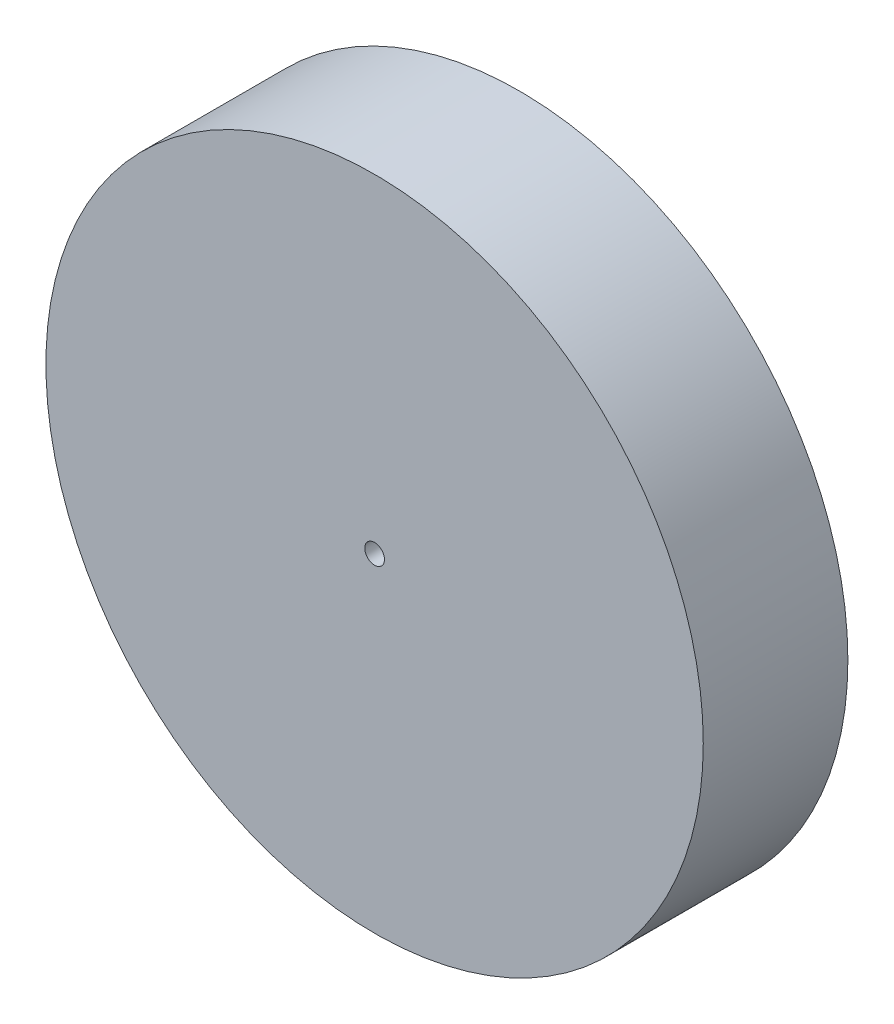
ISO-10303-21;
HEADER;
FILE_DESCRIPTION(('STEP AP214'),'2;1');
FILE_NAME('part.step','',(''),(''),'','','');
FILE_SCHEMA(('AUTOMOTIVE_DESIGN { 1 0 10303 214 1 1 1 1 }'));
ENDSEC;
DATA;
#1=APPLICATION_CONTEXT('core data for automotive mechanical design processes');
#2=APPLICATION_PROTOCOL_DEFINITION('international standard','automotive_design',2000,#1);
#3=PRODUCT_CONTEXT('',#1,'mechanical');
#4=PRODUCT('Part','Part','',(#3));
#5=PRODUCT_RELATED_PRODUCT_CATEGORY('part','',(#4));
#6=PRODUCT_DEFINITION_FORMATION('','',#4);
#7=PRODUCT_DEFINITION_CONTEXT('part definition',#1,'design');
#8=PRODUCT_DEFINITION('design','',#6,#7);
#9=PRODUCT_DEFINITION_SHAPE('','',#8);
#10=(LENGTH_UNIT() NAMED_UNIT(*) SI_UNIT(.MILLI.,.METRE.));
#11=(NAMED_UNIT(*) PLANE_ANGLE_UNIT() SI_UNIT($,.RADIAN.));
#12=(NAMED_UNIT(*) SI_UNIT($,.STERADIAN.) SOLID_ANGLE_UNIT());
#13=UNCERTAINTY_MEASURE_WITH_UNIT(LENGTH_MEASURE(1.E-05),#10,'distance_accuracy_value','');
#14=(GEOMETRIC_REPRESENTATION_CONTEXT(3) GLOBAL_UNCERTAINTY_ASSIGNED_CONTEXT((#13)) GLOBAL_UNIT_ASSIGNED_CONTEXT((#10,
#11,#12)) REPRESENTATION_CONTEXT('',''));
#15=CARTESIAN_POINT('',(0.,0.,0.));
#16=DIRECTION('',(0.,0.,1.));
#17=DIRECTION('',(1.,0.,0.));
#18=AXIS2_PLACEMENT_3D('',#15,#16,#17);
#19=CARTESIAN_POINT('',(0.,0.,22.352));
#20=DIRECTION('',(0.,0.,-1.));
#21=DIRECTION('',(-1.,0.,0.));
#22=AXIS2_PLACEMENT_3D('',#19,#20,#21);
#23=CYLINDRICAL_SURFACE('',#22,50.8);
#24=CARTESIAN_POINT('',(0.,0.,22.352));
#25=DIRECTION('',(0.,0.,1.));
#26=DIRECTION('',(1.,0.,0.));
#27=AXIS2_PLACEMENT_3D('',#24,#25,#26);
#28=CIRCLE('',#27,50.8);
#29=CARTESIAN_POINT('',(50.8,0.,22.352));
#30=VERTEX_POINT('',#29);
#31=EDGE_CURVE('E10',#30,#30,#28,.T.);
#32=ORIENTED_EDGE('',*,*,#31,.F.);
#33=EDGE_LOOP('',(#32));
#34=FACE_BOUND('',#33,.T.);
#35=CARTESIAN_POINT('',(0.,0.,0.));
#36=DIRECTION('',(0.,0.,1.));
#37=DIRECTION('',(1.,0.,0.));
#38=AXIS2_PLACEMENT_3D('',#35,#36,#37);
#39=CIRCLE('',#38,50.8);
#40=CARTESIAN_POINT('',(50.8,0.,0.));
#41=VERTEX_POINT('',#40);
#42=EDGE_CURVE('E34',#41,#41,#39,.T.);
#43=ORIENTED_EDGE('',*,*,#42,.T.);
#44=EDGE_LOOP('',(#43));
#45=FACE_BOUND('',#44,.T.);
#46=ADVANCED_FACE('F31',(#34,#45),#23,.T.);
#47=CARTESIAN_POINT('',(0.,0.,22.352));
#48=DIRECTION('',(0.,0.,1.));
#49=DIRECTION('',(1.,0.,0.));
#50=AXIS2_PLACEMENT_3D('',#47,#48,#49);
#51=PLANE('',#50);
#52=CARTESIAN_POINT('',(0.,0.,22.352));
#53=DIRECTION('',(0.,0.,1.));
#54=DIRECTION('',(1.,0.,0.));
#55=AXIS2_PLACEMENT_3D('',#52,#53,#54);
#56=CIRCLE('',#55,1.524);
#57=CARTESIAN_POINT('',(1.524,0.,22.352));
#58=VERTEX_POINT('',#57);
#59=EDGE_CURVE('E43',#58,#58,#56,.T.);
#60=ORIENTED_EDGE('',*,*,#59,.F.);
#61=EDGE_LOOP('',(#60));
#62=FACE_BOUND('',#61,.T.);
#63=ORIENTED_EDGE('',*,*,#31,.T.);
#64=EDGE_LOOP('',(#63));
#65=FACE_BOUND('',#64,.T.);
#66=ADVANCED_FACE('F58',(#62,#65),#51,.T.);
#67=CARTESIAN_POINT('',(0.,0.,0.));
#68=DIRECTION('',(0.,0.,1.));
#69=DIRECTION('',(1.,0.,0.));
#70=AXIS2_PLACEMENT_3D('',#67,#68,#69);
#71=PLANE('',#70);
#72=CARTESIAN_POINT('',(0.,0.,0.));
#73=DIRECTION('',(0.,0.,1.));
#74=DIRECTION('',(1.,0.,0.));
#75=AXIS2_PLACEMENT_3D('',#72,#73,#74);
#76=CIRCLE('',#75,1.524);
#77=CARTESIAN_POINT('',(1.524,0.,0.));
#78=VERTEX_POINT('',#77);
#79=EDGE_CURVE('E41',#78,#78,#76,.T.);
#80=ORIENTED_EDGE('',*,*,#79,.T.);
#81=EDGE_LOOP('',(#80));
#82=FACE_BOUND('',#81,.T.);
#83=ORIENTED_EDGE('',*,*,#42,.F.);
#84=EDGE_LOOP('',(#83));
#85=FACE_BOUND('',#84,.T.);
#86=ADVANCED_FACE('F49',(#82,#85),#71,.F.);
#87=CARTESIAN_POINT('',(0.,0.,0.));
#88=DIRECTION('',(0.,0.,1.));
#89=DIRECTION('',(1.,0.,0.));
#90=AXIS2_PLACEMENT_3D('',#87,#88,#89);
#91=CYLINDRICAL_SURFACE('',#90,1.524);
#92=ORIENTED_EDGE('',*,*,#79,.F.);
#93=EDGE_LOOP('',(#92));
#94=FACE_BOUND('',#93,.T.);
#95=ORIENTED_EDGE('',*,*,#59,.T.);
#96=EDGE_LOOP('',(#95));
#97=FACE_BOUND('',#96,.T.);
#98=ADVANCED_FACE('F52',(#94,#97),#91,.F.);
#99=CLOSED_SHELL('',(#46,#66,#86,#98));
#100=MANIFOLD_SOLID_BREP('B2',#99);
#101=ADVANCED_BREP_SHAPE_REPRESENTATION('',(#18,#100),#14);
#102=SHAPE_DEFINITION_REPRESENTATION(#9,#101);
ENDSEC;
END-ISO-10303-21;
